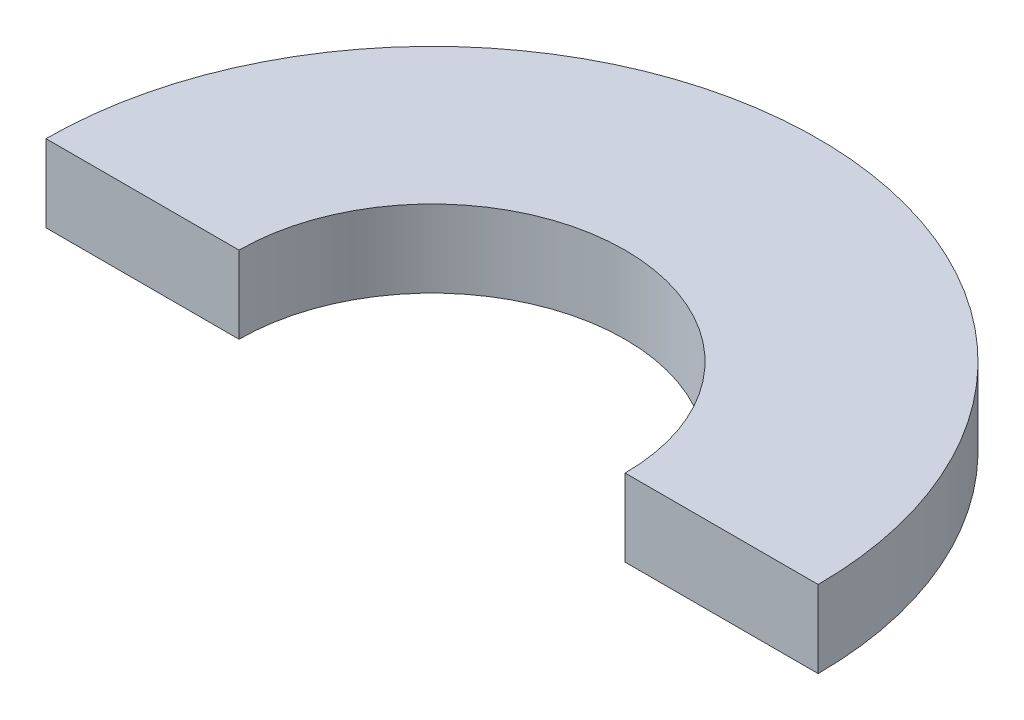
from build123d import *

# Parameters (mm, degrees)
ESQUISSE1_R      = 6
ESQUISSE1_R_2    = 3
EXTRUSION1_DEPTH = 1.2
ESQUISSE2_W      = 6
ESQUISSE2_H      = 1.2
COUPE_ANGLE      = 180


with BuildPart() as part:
    # Esquisse1 → Extrusion1 (new body)
    with BuildSketch(Plane(origin=(0, 0, 0), x_dir=(1, 0, 0), z_dir=(0, 1, 0))):
        Circle(ESQUISSE1_R)
        Circle(ESQUISSE1_R_2, mode=Mode.SUBTRACT)
    extrude(amount=EXTRUSION1_DEPTH)

    # Esquisse2 → Coupe (revolve, cut)
    with BuildSketch(Plane.XY):
        with Locations((3, 0.6)):
            Rectangle(ESQUISSE2_W, ESQUISSE2_H)
    revolve(axis=Axis((0, 4.670837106, 0), (0, -1, 0)), revolution_arc=COUPE_ANGLE, mode=Mode.SUBTRACT)


solid = part.part
